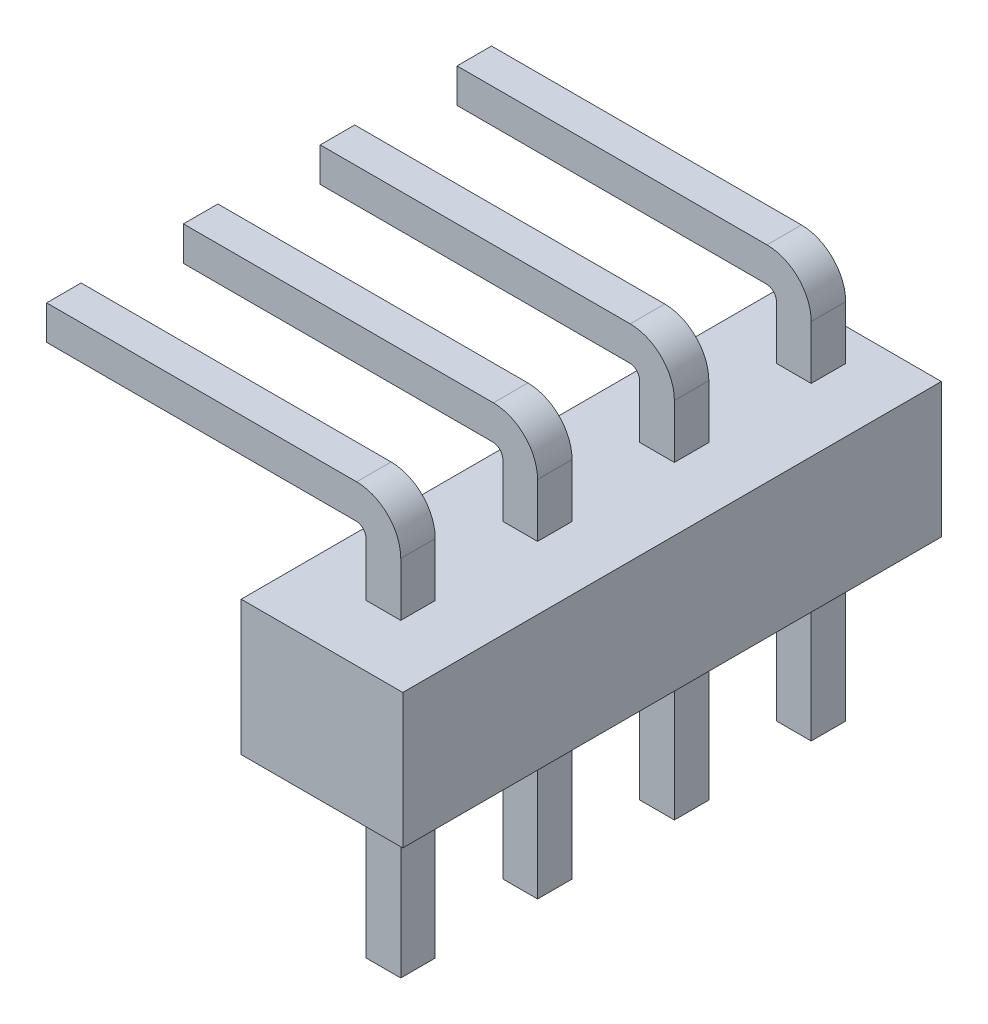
from build123d import *

# Parameters (mm, degrees)
SKETCH1_W       = 3
SKETCH1_H       = 2.5
EXTRUDE1_DEPTH  = 5
SKETCH2_W       = 0.645
SKETCH2_H       = 3.5
EXTRUDE2_DEPTH  = 0.64
LPATTERN1_COUNT = 4
LPATTERN1_PITCH = 2.54
CHAMFER1_SIZE   = 0.25


with BuildPart() as part:
    # Sketch1 → Extrude1 (new, symmetric)
    with BuildSketch(Plane.XY):
        Rectangle(SKETCH1_W, SKETCH1_H)
    extrude(amount=EXTRUDE1_DEPTH, both=True)

    # Sketch2 → Extrude2 (add)
    with BuildSketch(Plane.XY.offset(3.86)):
        with BuildLine():
            Line((-0.3225, 1.25), (-0.3225, 2.245))
            ThreePointArc((-0.3225, 2.245), (-0.374776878, 2.375), (-0.5025, 2.43261663))
            Line((-0.5025, 2.43261663), (-6.5025, 2.43261663))
            Line((-6.5025, 2.43261663), (-6.5025, 3.06831282))
            Line((-6.5025, 3.06831282), (-0.4975, 3.06831282))
            ThreePointArc((-0.4975, 3.06831282), (0.082527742, 2.826), (0.3225, 2.245))
            Line((0.3225, 2.245), (0.3225, 1.25))
            Line((0.3225, 1.25), (-0.3225, 1.25))
        make_face()
        with Locations((0, -3)):
            Rectangle(SKETCH2_W, SKETCH2_H)
    extrude2 = extrude(amount=-EXTRUDE2_DEPTH)

    # LPattern1: Extrude2 ×4
    with Locations(*[(0, 0, -i * LPATTERN1_PITCH) for i in range(1, LPATTERN1_COUNT)]):
        add(extrude2)

    # Chamfer1
    chamfer1_edges = [part.edges().sort_by_distance(p)[0] for p in [
        (-6.5025, 2.750464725, -4.4),
        (-6.5025, 2.43261663, -4.08),
        (-6.5025, 3.06831282, -4.08),
        (-6.5025, 2.750464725, -3.76),
        (0, -4.75, -4.4),
        (0.3225, -4.75, -4.08),
        (-0.3225, -4.75, -4.08),
        (0, -4.75, -3.76),
        (-6.5025, 2.750464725, 3.22),
        (-6.5025, 2.43261663, 3.54),
        (-6.5025, 3.06831282, 3.54),
        (-6.5025, 2.750464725, 3.86),
        (0, -4.75, 3.22),
        (0.3225, -4.75, 3.54),
        (-0.3225, -4.75, 3.54),
        (0, -4.75, 3.86),
        (-6.5025, 2.750464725, 0.68),
        (-6.5025, 2.43261663, 1),
        (-6.5025, 3.06831282, 1),
        (-6.5025, 2.750464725, 1.32),
        (0, -4.75, 0.68),
        (0.3225, -4.75, 1),
        (-0.3225, -4.75, 1),
        (0, -4.75, 1.32),
        (-6.5025, 2.750464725, -1.86),
        (-6.5025, 2.43261663, -1.54),
        (-6.5025, 3.06831282, -1.54),
        (-6.5025, 2.750464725, -1.22),
        (0, -4.75, -1.86),
        (0.3225, -4.75, -1.54),
        (-0.3225, -4.75, -1.54),
        (0, -4.75, -1.22),
    ]]
    chamfer(chamfer1_edges, length=CHAMFER1_SIZE)


solid = part.part
